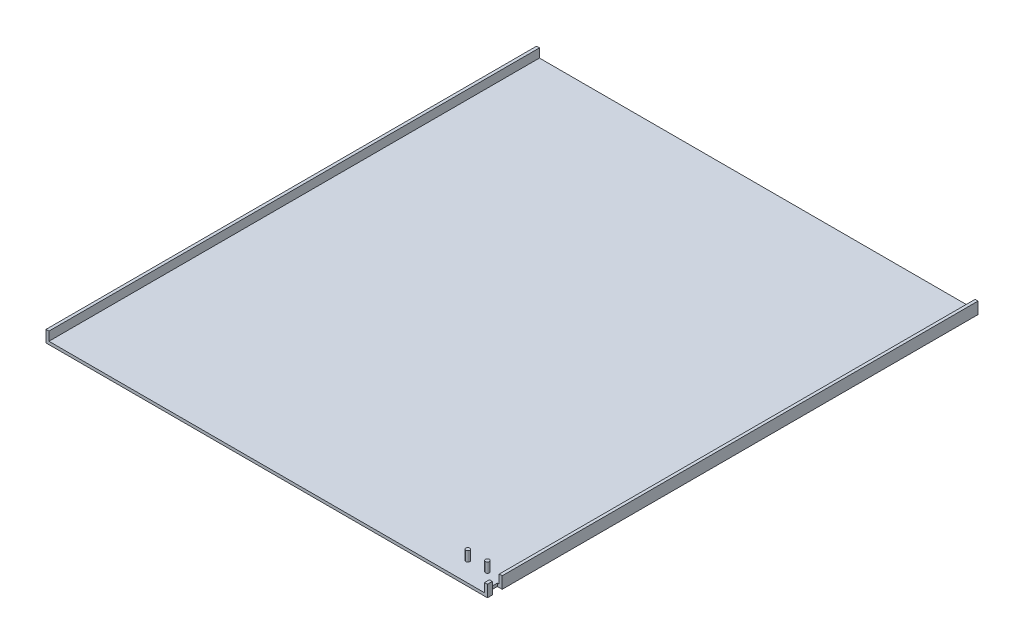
from build123d import *

# Parameters (mm, degrees)
LINEAR_AUSTRAGEN_D_NN1_DEPTH    = 500
SKIZZE2_R                       = 2
AUFSATZ_LINEAR_AUSTRAGEN1_DEPTH = 10
SKIZZE3_W                       = 10
SKIZZE3_H                       = 12
SCHNITT_LINEAR_AUSTRAGEN1_DEPTH = 5


with BuildPart() as part:
    # Skizze1 → Linear-Austragen-D_nn1 (new body)
    with BuildSketch(Plane.XY):
        Polygon((0, 12), (0, 0), (450, 0), (450, 12), (447, 12), (447, 3), (3, 3), (3, 12), align=None)
    extrude(amount=LINEAR_AUSTRAGEN_D_NN1_DEPTH)

    # Skizze2 → Aufsatz-Linear austragen1 (add)
    with BuildSketch(Plane(origin=(0, 3, 0), x_dir=(1, 0, 0), z_dir=(0, 1, 0))):
        with Locations(Location((430, -480, 0), (0, 0, 270))):
            Circle(SKIZZE2_R)
        with Locations(Location((410, -480, 0), (0, 0, 270))):
            Circle(SKIZZE2_R)
    extrude(amount=AUFSATZ_LINEAR_AUSTRAGEN1_DEPTH)

    # Skizze3 → Schnitt-Linear austragen1 (cut)
    with BuildSketch(Plane(origin=(450, 0, 0), x_dir=(0, 0, -1), z_dir=(1, 0, 0))):
        with Locations((-490, 6)):
            Rectangle(SKIZZE3_W, SKIZZE3_H)
    extrude(amount=-SCHNITT_LINEAR_AUSTRAGEN1_DEPTH, mode=Mode.SUBTRACT)


solid = part.part
